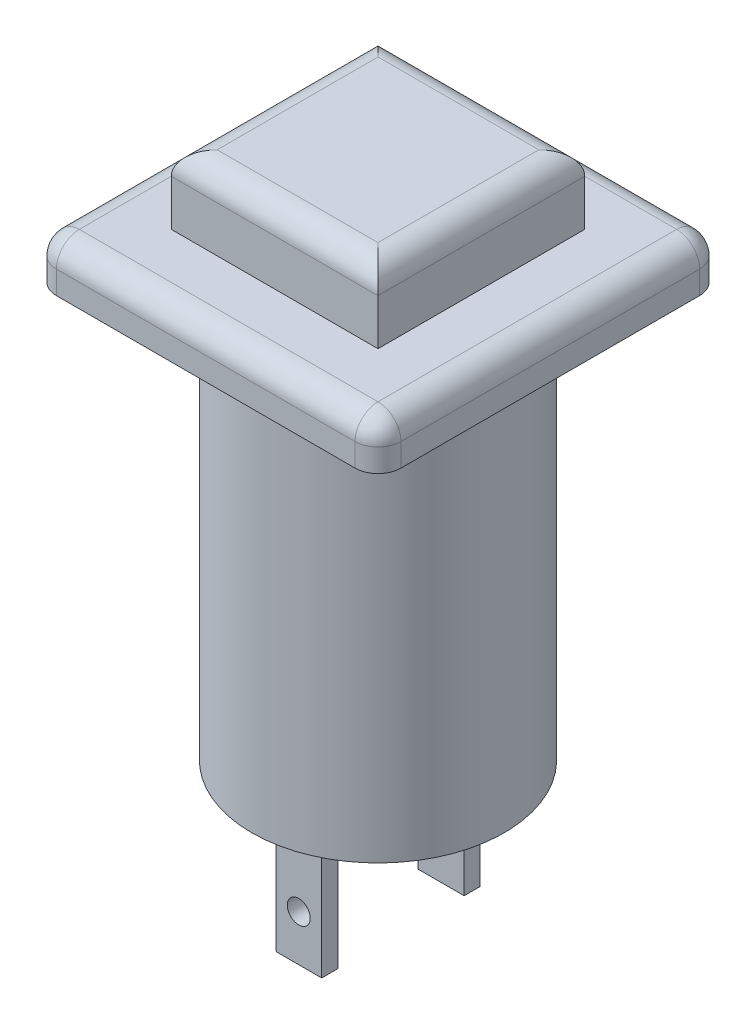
from build123d import *

# Parameters (mm, degrees)
ESQUISSE2_OUTSIDE_W     = 34.2
ESQUISSE2_OUTSIDE_H     = 34.2
ESQUISSE2_OUTSIDE_W_2   = 9
ESQUISSE2_OUTSIDE_H_2   = 9
ENL_V_MAT_EXTRU_1_DEPTH = 3
CONG_1_R                = 1
ESQUISSE3_OUTSIDE_W     = 34.2
ESQUISSE3_OUTSIDE_H     = 34.2
ESQUISSE3_OUTSIDE_W_2   = 15
ESQUISSE3_OUTSIDE_H_2   = 15
ENL_V_MAT_EXTRU_2_DEPTH = 10
CONG_2_R                = 1
ESQUISSE4_W             = 2
ESQUISSE4_H             = 0.7
EXTRUSION1_DEPTH        = 6
ESQUISSE5_R             = 0.5
ENL_V_MAT_EXTRU_3_DEPTH = 57.049958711


with BuildPart() as part:
    # Esquisse1 → R_volution1 (revolve)
    with BuildSketch(Plane.XY, mode=Mode.PRIVATE) as r_volution1_sk:
        Polygon((-19.183687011, -19.059090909), (-26.183687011, -19.059090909), (-26.183687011, -22.059090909), (-31.183687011, -22.059090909), (-31.183687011, -24.059090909), (-24.683687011, -24.059090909), (-24.683687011, -42.059090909), (-19.183687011, -42.059090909), align=None)
    revolve(r_volution1_sk.sketch.rotate(Axis((-19.183687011, -19.028648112, 0), (0, -1, 0)), 270), axis=Axis((-19.183687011, -19.028648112, 0), (0, -1, 0)))

    # Esquisse2 outside → Enl_v. mat.-Extru.1 (cut)
    with BuildSketch(Plane(origin=(0, -19.059090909, 0), x_dir=(-1, 0, 0), z_dir=(0, 1, 0))):
        with Locations((19.184, 0)):
            Rectangle(ESQUISSE2_OUTSIDE_W, ESQUISSE2_OUTSIDE_H)
        with Locations((19.183687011, 0)):
            Rectangle(ESQUISSE2_OUTSIDE_W_2, ESQUISSE2_OUTSIDE_H_2, mode=Mode.SUBTRACT)
    extrude(amount=-ENL_V_MAT_EXTRU_1_DEPTH, mode=Mode.SUBTRACT)

    # Cong_1
    cong_1_edges = [part.edges().sort_by_distance(p)[0] for p in [
        (-19.183687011, -19.059090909, 4.5),
        (-23.683687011, -19.059090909, 0),
        (-19.183687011, -19.059090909, -4.5),
        (-14.683687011, -19.059090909, 0),
    ]]
    fillet(cong_1_edges, radius=CONG_1_R)

    # Esquisse3 outside → Enl_v. mat.-Extru.2 (cut)
    with BuildSketch(Plane(origin=(0, -22.059090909, 0), x_dir=(-1, 0, 0), z_dir=(0, 1, 0))):
        with Locations((19.184, 0)):
            Rectangle(ESQUISSE3_OUTSIDE_W, ESQUISSE3_OUTSIDE_H)
        with Locations((19.183687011, 0)):
            Rectangle(ESQUISSE3_OUTSIDE_W_2, ESQUISSE3_OUTSIDE_H_2, mode=Mode.SUBTRACT)
    extrude(amount=-ENL_V_MAT_EXTRU_2_DEPTH, mode=Mode.SUBTRACT)

    # Cong_2
    cong_2_edges = [part.edges().sort_by_distance(p)[0] for p in [
        (-19.183687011, -22.059090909, 7.5),
        (-26.683687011, -22.059090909, 0),
        (-19.183687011, -22.059090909, -7.5),
        (-11.683687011, -22.059090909, 0),
        (-26.683687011, -23.059090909, 7.5),
        (-11.683687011, -23.059090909, 7.5),
        (-26.683687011, -23.059090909, -7.5),
        (-11.683687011, -23.059090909, -7.5),
    ]]
    fillet(cong_2_edges, radius=CONG_2_R)

    # Esquisse4 → Extrusion1 (add)
    with BuildSketch(Plane.XZ.offset(42.059090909)):
        with Locations((-19.183687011, 3.1)):
            Rectangle(ESQUISSE4_W, ESQUISSE4_H)
        with Locations((-19.183687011, -3.1)):
            Rectangle(ESQUISSE4_W, ESQUISSE4_H)
    extrude(amount=EXTRUSION1_DEPTH)

    # Esquisse5 → Enl_v. mat.-Extru.3 (cut, through all)
    with BuildSketch(Plane.XY.offset(3.45)):
        with Locations((-19.183687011, -46.059090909)):
            Circle(ESQUISSE5_R)
    extrude(amount=-ENL_V_MAT_EXTRU_3_DEPTH, mode=Mode.SUBTRACT)


solid = part.part
